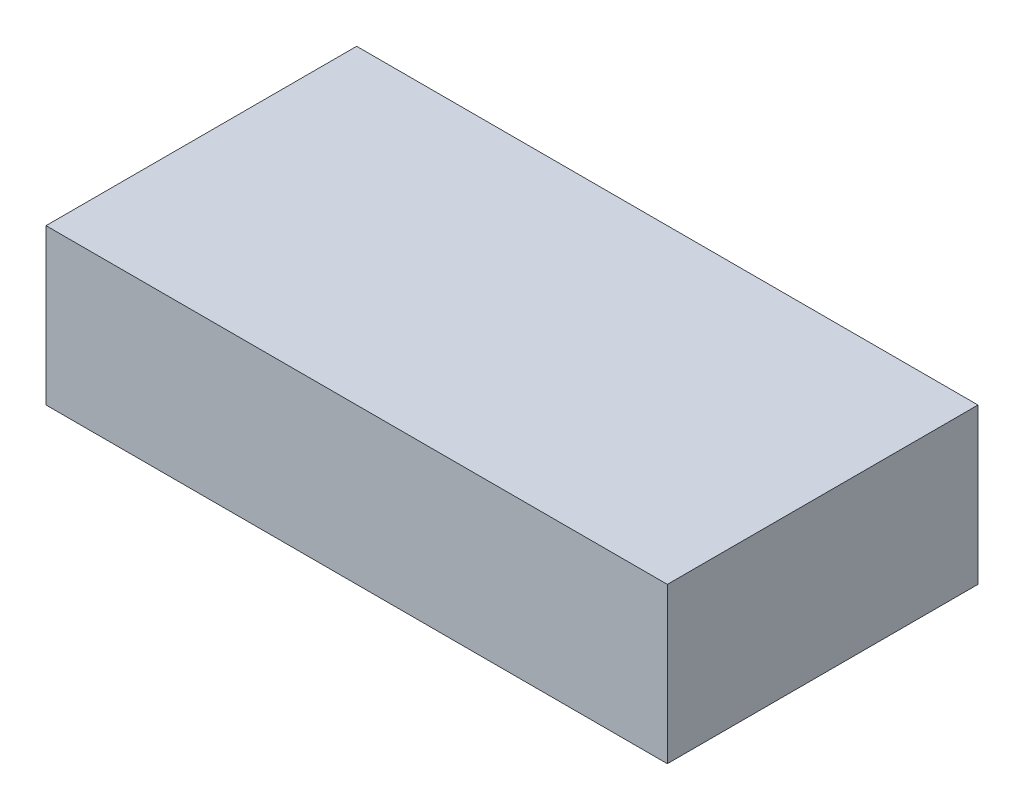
from build123d import *

# Parameters (mm, degrees)
SKETCH1_W           = 203.2
SKETCH1_H           = 101.6
BOSS_EXTRUDE1_DEPTH = 50.8


with BuildPart() as part:
    # Sketch1 → Boss-Extrude1 (new body)
    with BuildSketch(Plane(origin=(0, 0, 0), x_dir=(1, 0, 0), z_dir=(0, 1, 0))):
        with Locations((101.6, -50.8)):
            Rectangle(SKETCH1_W, SKETCH1_H)
    extrude(amount=BOSS_EXTRUDE1_DEPTH)


solid = part.part
